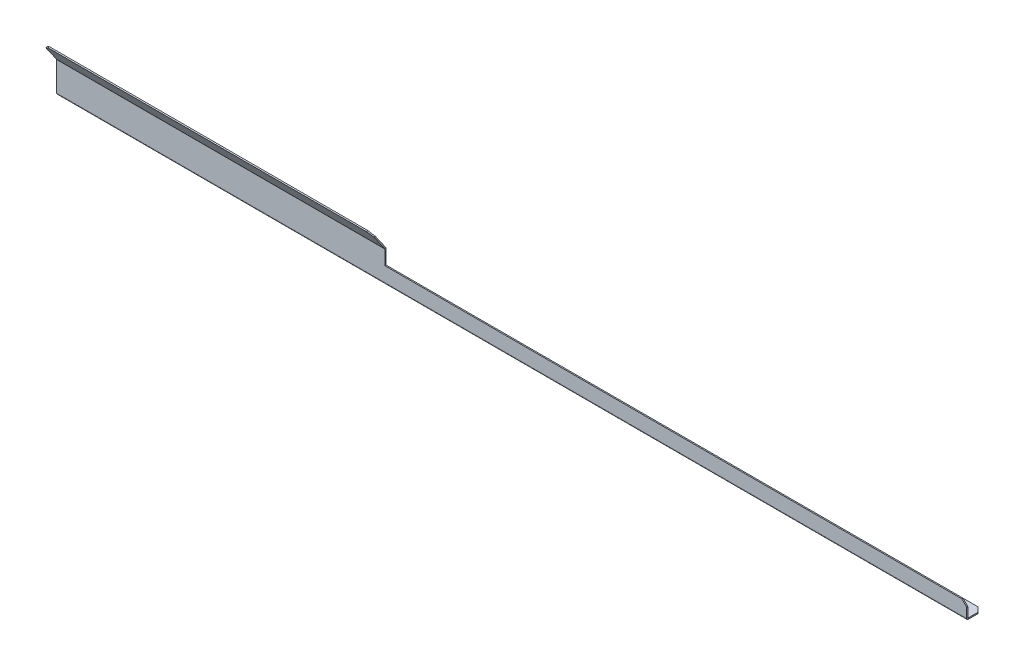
ISO-10303-21;
HEADER;
FILE_DESCRIPTION(('STEP AP214'),'2;1');
FILE_NAME('part.step','',(''),(''),'','','');
FILE_SCHEMA(('AUTOMOTIVE_DESIGN { 1 0 10303 214 1 1 1 1 }'));
ENDSEC;
DATA;
#1=APPLICATION_CONTEXT('core data for automotive mechanical design processes');
#2=APPLICATION_PROTOCOL_DEFINITION('international standard','automotive_design',2000,#1);
#3=PRODUCT_CONTEXT('',#1,'mechanical');
#4=PRODUCT('Part','Part','',(#3));
#5=PRODUCT_RELATED_PRODUCT_CATEGORY('part','',(#4));
#6=PRODUCT_DEFINITION_FORMATION('','',#4);
#7=PRODUCT_DEFINITION_CONTEXT('part definition',#1,'design');
#8=PRODUCT_DEFINITION('design','',#6,#7);
#9=PRODUCT_DEFINITION_SHAPE('','',#8);
#10=(LENGTH_UNIT() NAMED_UNIT(*) SI_UNIT(.MILLI.,.METRE.));
#11=(NAMED_UNIT(*) PLANE_ANGLE_UNIT() SI_UNIT($,.RADIAN.));
#12=(NAMED_UNIT(*) SI_UNIT($,.STERADIAN.) SOLID_ANGLE_UNIT());
#13=UNCERTAINTY_MEASURE_WITH_UNIT(LENGTH_MEASURE(1.E-05),#10,'distance_accuracy_value','');
#14=(GEOMETRIC_REPRESENTATION_CONTEXT(3) GLOBAL_UNCERTAINTY_ASSIGNED_CONTEXT((#13)) GLOBAL_UNIT_ASSIGNED_CONTEXT((#10,
#11,#12)) REPRESENTATION_CONTEXT('',''));
#15=CARTESIAN_POINT('',(0.,0.,0.));
#16=DIRECTION('',(0.,0.,1.));
#17=DIRECTION('',(1.,0.,0.));
#18=AXIS2_PLACEMENT_3D('',#15,#16,#17);
#19=CARTESIAN_POINT('',(3050.,98.9970824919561,54.180847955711));
#20=DIRECTION('',(1.,0.,0.));
#21=DIRECTION('',(0.,0.,-1.));
#22=AXIS2_PLACEMENT_3D('',#19,#20,#21);
#23=PLANE('',#22);
#24=DIRECTION('',(0.,1.,0.));
#25=VECTOR('',#24,1.);
#26=CARTESIAN_POINT('',(3050.,0.,50.));
#27=LINE('',#26,#25);
#28=CARTESIAN_POINT('',(3050.,0.999999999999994,50.));
#29=VERTEX_POINT('',#28);
#30=CARTESIAN_POINT('',(3050.,34.,50.));
#31=VERTEX_POINT('',#30);
#32=EDGE_CURVE('E217',#29,#31,#27,.T.);
#33=ORIENTED_EDGE('',*,*,#32,.T.);
#34=DIRECTION('',(0.,0.,1.));
#35=VECTOR('',#34,1.);
#36=CARTESIAN_POINT('',(3050.,34.,54.180847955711));
#37=LINE('',#36,#35);
#38=CARTESIAN_POINT('',(3050.,34.,54.));
#39=VERTEX_POINT('',#38);
#40=EDGE_CURVE('E313',#31,#39,#37,.T.);
#41=ORIENTED_EDGE('',*,*,#40,.T.);
#42=DIRECTION('',(0.,1.,0.));
#43=VECTOR('',#42,1.);
#44=CARTESIAN_POINT('',(3050.,50.,54.));
#45=LINE('',#44,#43);
#46=CARTESIAN_POINT('',(3050.,0.999999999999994,54.));
#47=VERTEX_POINT('',#46);
#48=EDGE_CURVE('E204',#47,#39,#45,.T.);
#49=ORIENTED_EDGE('',*,*,#48,.F.);
#50=DIRECTION('',(0.,0.,-1.));
#51=VECTOR('',#50,1.);
#52=CARTESIAN_POINT('',(3050.,0.999999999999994,54.));
#53=LINE('',#52,#51);
#54=EDGE_CURVE('E287',#47,#29,#53,.T.);
#55=ORIENTED_EDGE('',*,*,#54,.T.);
#56=EDGE_LOOP('',(#33,#41,#49,#55));
#57=FACE_BOUND('',#56,.T.);
#58=ADVANCED_FACE('F39',(#57),#23,.T.);
#59=CARTESIAN_POINT('',(3050.,100.,50.));
#60=DIRECTION('',(0.,-0.573576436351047,0.819152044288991));
#61=DIRECTION('',(0.,-0.819152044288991,-0.573576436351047));
#62=AXIS2_PLACEMENT_3D('',#59,#60,#61);
#63=PLANE('',#62);
#64=DIRECTION('',(0.,0.819152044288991,0.573576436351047));
#65=VECTOR('',#64,1.);
#66=CARTESIAN_POINT('',(0.,100.,50.));
#67=LINE('',#66,#65);
#68=CARTESIAN_POINT('',(0.,101.29138823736,50.904239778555));
#69=VERTEX_POINT('',#68);
#70=CARTESIAN_POINT('',(0.,152.425730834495,86.708891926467));
#71=VERTEX_POINT('',#70);
#72=EDGE_CURVE('E180',#69,#71,#67,.T.);
#73=ORIENTED_EDGE('',*,*,#72,.T.);
#74=DIRECTION('',(-0.707106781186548,-0.579227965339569,-0.405579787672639));
#75=VECTOR('',#74,1.);
#76=CARTESIAN_POINT('',(0.,152.425730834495,86.708891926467));
#77=LINE('',#76,#75);
#78=CARTESIAN_POINT('',(16.,165.532163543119,95.8861149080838));
#79=VERTEX_POINT('',#78);
#80=EDGE_CURVE('E307',#71,#79,#77,.F.);
#81=ORIENTED_EDGE('',*,*,#80,.T.);
#82=DIRECTION('',(-1.,0.,0.));
#83=VECTOR('',#82,1.);
#84=CARTESIAN_POINT('',(3050.,165.532163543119,95.8861149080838));
#85=LINE('',#84,#83);
#86=CARTESIAN_POINT('',(1084.,165.532163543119,95.8861149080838));
#87=VERTEX_POINT('',#86);
#88=EDGE_CURVE('E273',#87,#79,#85,.T.);
#89=ORIENTED_EDGE('',*,*,#88,.F.);
#90=DIRECTION('',(-0.707106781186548,0.579227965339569,0.40557978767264));
#91=VECTOR('',#90,1.);
#92=CARTESIAN_POINT('',(1084.,165.532163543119,95.8861149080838));
#93=LINE('',#92,#91);
#94=CARTESIAN_POINT('',(1100.,152.425730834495,86.708891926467));
#95=VERTEX_POINT('',#94);
#96=EDGE_CURVE('E298',#87,#95,#93,.F.);
#97=ORIENTED_EDGE('',*,*,#96,.T.);
#98=DIRECTION('',(0.,0.819152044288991,0.573576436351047));
#99=VECTOR('',#98,1.);
#100=CARTESIAN_POINT('',(1100.,100.,50.));
#101=LINE('',#100,#99);
#102=CARTESIAN_POINT('',(1100.,101.29138823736,50.904239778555));
#103=VERTEX_POINT('',#102);
#104=EDGE_CURVE('E196',#103,#95,#101,.T.);
#105=ORIENTED_EDGE('',*,*,#104,.F.);
#106=DIRECTION('',(-1.,0.,0.));
#107=VECTOR('',#106,1.);
#108=CARTESIAN_POINT('',(3050.,101.29138823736,50.904239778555));
#109=LINE('',#108,#107);
#110=EDGE_CURVE('E220',#103,#69,#109,.T.);
#111=ORIENTED_EDGE('',*,*,#110,.T.);
#112=EDGE_LOOP('',(#73,#81,#89,#97,#105,#111));
#113=FACE_BOUND('',#112,.T.);
#114=ADVANCED_FACE('F370',(#113),#63,.F.);
#115=CARTESIAN_POINT('',(3050.,163.237857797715,99.1627230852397));
#116=DIRECTION('',(0.,0.819152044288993,0.573576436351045));
#117=DIRECTION('',(0.,-0.573576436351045,0.819152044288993));
#118=AXIS2_PLACEMENT_3D('',#115,#116,#117);
#119=PLANE('',#118);
#120=ORIENTED_EDGE('',*,*,#88,.T.);
#121=DIRECTION('',(0.,-0.573576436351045,0.819152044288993));
#122=VECTOR('',#121,1.);
#123=CARTESIAN_POINT('',(16.,163.237857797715,99.1627230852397));
#124=LINE('',#123,#122);
#125=CARTESIAN_POINT('',(16.,163.237857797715,99.1627230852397));
#126=VERTEX_POINT('',#125);
#127=EDGE_CURVE('E309',#79,#126,#124,.T.);
#128=ORIENTED_EDGE('',*,*,#127,.T.);
#129=DIRECTION('',(-1.,0.,0.));
#130=VECTOR('',#129,1.);
#131=CARTESIAN_POINT('',(3050.,163.237857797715,99.1627230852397));
#132=LINE('',#131,#130);
#133=CARTESIAN_POINT('',(1084.,163.237857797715,99.1627230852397));
#134=VERTEX_POINT('',#133);
#135=EDGE_CURVE('E270',#134,#126,#132,.T.);
#136=ORIENTED_EDGE('',*,*,#135,.F.);
#137=DIRECTION('',(0.,0.573576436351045,-0.819152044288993));
#138=VECTOR('',#137,1.);
#139=CARTESIAN_POINT('',(1084.,163.237857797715,99.1627230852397));
#140=LINE('',#139,#138);
#141=EDGE_CURVE('E295',#134,#87,#140,.T.);
#142=ORIENTED_EDGE('',*,*,#141,.T.);
#143=EDGE_LOOP('',(#120,#128,#136,#142));
#144=FACE_BOUND('',#143,.T.);
#145=ADVANCED_FACE('F376',(#144),#119,.T.);
#146=CARTESIAN_POINT('',(3050.,97.7056942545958,53.276608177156));
#147=DIRECTION('',(0.,-0.573576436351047,0.819152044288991));
#148=DIRECTION('',(0.,-0.819152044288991,-0.573576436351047));
#149=AXIS2_PLACEMENT_3D('',#146,#147,#148);
#150=PLANE('',#149);
#151=ORIENTED_EDGE('',*,*,#135,.T.);
#152=DIRECTION('',(0.707106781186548,0.579227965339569,0.405579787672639));
#153=VECTOR('',#152,1.);
#154=CARTESIAN_POINT('',(1493.,1373.12542721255,946.335119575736));
#155=LINE('',#154,#153);
#156=CARTESIAN_POINT('',(0.,150.131425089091,89.985500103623));
#157=VERTEX_POINT('',#156);
#158=EDGE_CURVE('E311',#126,#157,#155,.F.);
#159=ORIENTED_EDGE('',*,*,#158,.T.);
#160=DIRECTION('',(0.,0.819152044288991,0.573576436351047));
#161=VECTOR('',#160,1.);
#162=CARTESIAN_POINT('',(0.,97.7056942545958,53.276608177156));
#163=LINE('',#162,#161);
#164=CARTESIAN_POINT('',(0.,98.9970824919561,54.180847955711));
#165=VERTEX_POINT('',#164);
#166=EDGE_CURVE('E223',#165,#157,#163,.T.);
#167=ORIENTED_EDGE('',*,*,#166,.F.);
#168=DIRECTION('',(-1.,0.,0.));
#169=VECTOR('',#168,1.);
#170=CARTESIAN_POINT('',(3050.,98.9970824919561,54.180847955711));
#171=LINE('',#170,#169);
#172=CARTESIAN_POINT('',(1100.,98.9970824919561,54.180847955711));
#173=VERTEX_POINT('',#172);
#174=EDGE_CURVE('E268',#173,#165,#171,.T.);
#175=ORIENTED_EDGE('',*,*,#174,.F.);
#176=DIRECTION('',(0.,0.819152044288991,0.573576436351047));
#177=VECTOR('',#176,1.);
#178=CARTESIAN_POINT('',(1100.,97.7056942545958,53.276608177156));
#179=LINE('',#178,#177);
#180=CARTESIAN_POINT('',(1100.,150.131425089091,89.985500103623));
#181=VERTEX_POINT('',#180);
#182=EDGE_CURVE('E200',#173,#181,#179,.T.);
#183=ORIENTED_EDGE('',*,*,#182,.T.);
#184=DIRECTION('',(0.707106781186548,-0.579227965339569,-0.40557978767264));
#185=VECTOR('',#184,1.);
#186=CARTESIAN_POINT('',(2107.,-674.754683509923,-487.605971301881));
#187=LINE('',#186,#185);
#188=EDGE_CURVE('E302',#181,#134,#187,.F.);
#189=ORIENTED_EDGE('',*,*,#188,.T.);
#190=EDGE_LOOP('',(#151,#159,#167,#175,#183,#189));
#191=FACE_BOUND('',#190,.T.);
#192=ADVANCED_FACE('F437',(#191),#150,.T.);
#193=CARTESIAN_POINT('',(3050.,98.4235060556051,55.));
#194=DIRECTION('',(-1.,0.,0.));
#195=DIRECTION('',(0.,0.,1.));
#196=AXIS2_PLACEMENT_3D('',#193,#194,#195);
#197=CYLINDRICAL_SURFACE('',#196,1.);
#198=DIRECTION('',(-1.,0.,0.));
#199=VECTOR('',#198,1.);
#200=CARTESIAN_POINT('',(3050.,98.4235060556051,54.));
#201=LINE('',#200,#199);
#202=CARTESIAN_POINT('',(1100.,98.4235060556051,54.));
#203=VERTEX_POINT('',#202);
#204=CARTESIAN_POINT('',(0.,98.4235060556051,54.));
#205=VERTEX_POINT('',#204);
#206=EDGE_CURVE('E266',#203,#205,#201,.T.);
#207=ORIENTED_EDGE('',*,*,#206,.F.);
#208=CARTESIAN_POINT('',(1100.,98.4235060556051,55.));
#209=DIRECTION('',(1.,0.,0.));
#210=DIRECTION('',(0.,0.,-1.));
#211=AXIS2_PLACEMENT_3D('',#208,#209,#210);
#212=CIRCLE('',#211,1.);
#213=EDGE_CURVE('E189',#203,#173,#212,.T.);
#214=ORIENTED_EDGE('',*,*,#213,.T.);
#215=ORIENTED_EDGE('',*,*,#174,.T.);
#216=CARTESIAN_POINT('',(0.,98.4235060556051,55.));
#217=DIRECTION('',(1.,0.,0.));
#218=DIRECTION('',(0.,0.,-1.));
#219=AXIS2_PLACEMENT_3D('',#216,#217,#218);
#220=CIRCLE('',#219,1.);
#221=EDGE_CURVE('E226',#205,#165,#220,.T.);
#222=ORIENTED_EDGE('',*,*,#221,.F.);
#223=EDGE_LOOP('',(#207,#214,#215,#222));
#224=FACE_BOUND('',#223,.T.);
#225=ADVANCED_FACE('F444',(#224),#197,.F.);
#226=CARTESIAN_POINT('',(3050.,0.,54.));
#227=DIRECTION('',(0.,0.,1.));
#228=DIRECTION('',(1.,0.,0.));
#229=AXIS2_PLACEMENT_3D('',#226,#227,#228);
#230=PLANE('',#229);
#231=ORIENTED_EDGE('',*,*,#48,.T.);
#232=DIRECTION('',(0.707106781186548,-0.707106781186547,0.));
#233=VECTOR('',#232,1.);
#234=CARTESIAN_POINT('',(3067.,17.,54.));
#235=LINE('',#234,#233);
#236=CARTESIAN_POINT('',(3034.,50.,54.));
#237=VERTEX_POINT('',#236);
#238=EDGE_CURVE('E176',#39,#237,#235,.F.);
#239=ORIENTED_EDGE('',*,*,#238,.T.);
#240=DIRECTION('',(-1.,0.,0.));
#241=VECTOR('',#240,1.);
#242=CARTESIAN_POINT('',(3050.,50.,54.));
#243=LINE('',#242,#241);
#244=CARTESIAN_POINT('',(1100.,50.,54.));
#245=VERTEX_POINT('',#244);
#246=EDGE_CURVE('E170',#237,#245,#243,.T.);
#247=ORIENTED_EDGE('',*,*,#246,.T.);
#248=DIRECTION('',(0.,1.,0.));
#249=VECTOR('',#248,1.);
#250=CARTESIAN_POINT('',(1100.,0.,54.));
#251=LINE('',#250,#249);
#252=EDGE_CURVE('E174',#245,#203,#251,.T.);
#253=ORIENTED_EDGE('',*,*,#252,.T.);
#254=ORIENTED_EDGE('',*,*,#206,.T.);
#255=DIRECTION('',(0.,1.,0.));
#256=VECTOR('',#255,1.);
#257=CARTESIAN_POINT('',(0.,0.,54.));
#258=LINE('',#257,#256);
#259=CARTESIAN_POINT('',(0.,0.999999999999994,54.));
#260=VERTEX_POINT('',#259);
#261=EDGE_CURVE('E229',#260,#205,#258,.T.);
#262=ORIENTED_EDGE('',*,*,#261,.F.);
#263=DIRECTION('',(-1.,0.,0.));
#264=VECTOR('',#263,1.);
#265=CARTESIAN_POINT('',(3050.,0.999999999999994,54.));
#266=LINE('',#265,#264);
#267=EDGE_CURVE('E263',#47,#260,#266,.T.);
#268=ORIENTED_EDGE('',*,*,#267,.F.);
#269=EDGE_LOOP('',(#231,#239,#247,#253,#254,#262,#268));
#270=FACE_BOUND('',#269,.T.);
#271=ADVANCED_FACE('F173',(#270),#230,.T.);
#272=CARTESIAN_POINT('',(3050.,50.,50.));
#273=DIRECTION('',(0.,0.,1.));
#274=DIRECTION('',(1.,0.,0.));
#275=AXIS2_PLACEMENT_3D('',#272,#273,#274);
#276=PLANE('',#275);
#277=DIRECTION('',(-1.,0.,0.));
#278=VECTOR('',#277,1.);
#279=CARTESIAN_POINT('',(3050.,50.,50.));
#280=LINE('',#279,#278);
#281=CARTESIAN_POINT('',(3034.,50.,50.));
#282=VERTEX_POINT('',#281);
#283=CARTESIAN_POINT('',(1100.,50.,50.));
#284=VERTEX_POINT('',#283);
#285=EDGE_CURVE('E193',#282,#284,#280,.T.);
#286=ORIENTED_EDGE('',*,*,#285,.F.);
#287=DIRECTION('',(-0.707106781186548,0.707106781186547,0.));
#288=VECTOR('',#287,1.);
#289=CARTESIAN_POINT('',(3050.,34.,50.));
#290=LINE('',#289,#288);
#291=EDGE_CURVE('E319',#282,#31,#290,.F.);
#292=ORIENTED_EDGE('',*,*,#291,.T.);
#293=ORIENTED_EDGE('',*,*,#32,.F.);
#294=DIRECTION('',(-1.,0.,0.));
#295=VECTOR('',#294,1.);
#296=CARTESIAN_POINT('',(3050.,0.999999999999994,50.));
#297=LINE('',#296,#295);
#298=CARTESIAN_POINT('',(0.,0.999999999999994,50.));
#299=VERTEX_POINT('',#298);
#300=EDGE_CURVE('E250',#29,#299,#297,.T.);
#301=ORIENTED_EDGE('',*,*,#300,.T.);
#302=DIRECTION('',(0.,1.,0.));
#303=VECTOR('',#302,1.);
#304=CARTESIAN_POINT('',(0.,50.,50.));
#305=LINE('',#304,#303);
#306=CARTESIAN_POINT('',(0.,98.4235060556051,50.));
#307=VERTEX_POINT('',#306);
#308=EDGE_CURVE('E242',#299,#307,#305,.T.);
#309=ORIENTED_EDGE('',*,*,#308,.T.);
#310=DIRECTION('',(-1.,0.,0.));
#311=VECTOR('',#310,1.);
#312=CARTESIAN_POINT('',(3050.,98.4235060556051,50.));
#313=LINE('',#312,#311);
#314=CARTESIAN_POINT('',(1100.,98.4235060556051,50.));
#315=VERTEX_POINT('',#314);
#316=EDGE_CURVE('E248',#315,#307,#313,.T.);
#317=ORIENTED_EDGE('',*,*,#316,.F.);
#318=DIRECTION('',(0.,1.,0.));
#319=VECTOR('',#318,1.);
#320=CARTESIAN_POINT('',(1100.,50.,50.));
#321=LINE('',#320,#319);
#322=EDGE_CURVE('E194',#284,#315,#321,.T.);
#323=ORIENTED_EDGE('',*,*,#322,.F.);
#324=EDGE_LOOP('',(#286,#292,#293,#301,#309,#317,#323));
#325=FACE_BOUND('',#324,.T.);
#326=ADVANCED_FACE('F414',(#325),#276,.F.);
#327=CARTESIAN_POINT('',(3050.,98.4235060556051,55.));
#328=DIRECTION('',(-1.,0.,0.));
#329=DIRECTION('',(0.,0.,1.));
#330=AXIS2_PLACEMENT_3D('',#327,#328,#329);
#331=CYLINDRICAL_SURFACE('',#330,5.);
#332=CARTESIAN_POINT('',(1100.,98.4235060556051,55.));
#333=DIRECTION('',(1.,0.,0.));
#334=DIRECTION('',(0.,0.,-1.));
#335=AXIS2_PLACEMENT_3D('',#332,#333,#334);
#336=CIRCLE('',#335,5.);
#337=EDGE_CURVE('E292',#315,#103,#336,.T.);
#338=ORIENTED_EDGE('',*,*,#337,.F.);
#339=ORIENTED_EDGE('',*,*,#316,.T.);
#340=CARTESIAN_POINT('',(0.,98.4235060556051,55.));
#341=DIRECTION('',(-1.,0.,0.));
#342=DIRECTION('',(0.,0.,1.));
#343=AXIS2_PLACEMENT_3D('',#340,#341,#342);
#344=CIRCLE('',#343,5.);
#345=EDGE_CURVE('E207',#307,#69,#344,.F.);
#346=ORIENTED_EDGE('',*,*,#345,.T.);
#347=ORIENTED_EDGE('',*,*,#110,.F.);
#348=EDGE_LOOP('',(#338,#339,#346,#347));
#349=FACE_BOUND('',#348,.T.);
#350=ADVANCED_FACE('F396',(#349),#331,.T.);
#351=CARTESIAN_POINT('',(3050.,0.,49.));
#352=DIRECTION('',(1.,0.,0.));
#353=DIRECTION('',(0.,0.,-1.));
#354=AXIS2_PLACEMENT_3D('',#351,#352,#353);
#355=PLANE('',#354);
#356=DIRECTION('',(0.,-1.,0.));
#357=VECTOR('',#356,1.);
#358=CARTESIAN_POINT('',(3050.,0.,49.));
#359=LINE('',#358,#357);
#360=CARTESIAN_POINT('',(3050.,0.,49.));
#361=VERTEX_POINT('',#360);
#362=CARTESIAN_POINT('',(3050.,-4.00000000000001,49.));
#363=VERTEX_POINT('',#362);
#364=EDGE_CURVE('E289',#361,#363,#359,.T.);
#365=ORIENTED_EDGE('',*,*,#364,.F.);
#366=CARTESIAN_POINT('',(3050.,0.999999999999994,49.));
#367=DIRECTION('',(1.,0.,0.));
#368=DIRECTION('',(0.,0.,-1.));
#369=AXIS2_PLACEMENT_3D('',#366,#367,#368);
#370=CIRCLE('',#369,1.);
#371=EDGE_CURVE('E214',#361,#29,#370,.F.);
#372=ORIENTED_EDGE('',*,*,#371,.T.);
#373=ORIENTED_EDGE('',*,*,#54,.F.);
#374=CARTESIAN_POINT('',(3050.,0.999999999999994,49.));
#375=DIRECTION('',(1.,0.,0.));
#376=DIRECTION('',(0.,0.,-1.));
#377=AXIS2_PLACEMENT_3D('',#374,#375,#376);
#378=CIRCLE('',#377,5.);
#379=EDGE_CURVE('E206',#363,#47,#378,.F.);
#380=ORIENTED_EDGE('',*,*,#379,.F.);
#381=EDGE_LOOP('',(#365,#372,#373,#380));
#382=FACE_BOUND('',#381,.T.);
#383=ADVANCED_FACE('F392',(#382),#355,.T.);
#384=CARTESIAN_POINT('',(3050.,0.999999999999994,54.));
#385=DIRECTION('',(1.,0.,0.));
#386=DIRECTION('',(0.,0.,-1.));
#387=AXIS2_PLACEMENT_3D('',#384,#385,#386);
#388=PLANE('',#387);
#389=DIRECTION('',(0.,0.,1.));
#390=VECTOR('',#389,1.);
#391=CARTESIAN_POINT('',(3050.,-4.,0.));
#392=LINE('',#391,#390);
#393=CARTESIAN_POINT('',(3050.,-4.,16.));
#394=VERTEX_POINT('',#393);
#395=EDGE_CURVE('E210',#394,#363,#392,.T.);
#396=ORIENTED_EDGE('',*,*,#395,.F.);
#397=DIRECTION('',(0.,1.,0.));
#398=VECTOR('',#397,1.);
#399=CARTESIAN_POINT('',(3050.,0.999999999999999,16.));
#400=LINE('',#399,#398);
#401=CARTESIAN_POINT('',(3050.,0.,16.));
#402=VERTEX_POINT('',#401);
#403=EDGE_CURVE('E326',#394,#402,#400,.T.);
#404=ORIENTED_EDGE('',*,*,#403,.T.);
#405=DIRECTION('',(0.,0.,1.));
#406=VECTOR('',#405,1.);
#407=CARTESIAN_POINT('',(3050.,0.,0.));
#408=LINE('',#407,#406);
#409=EDGE_CURVE('E212',#402,#361,#408,.T.);
#410=ORIENTED_EDGE('',*,*,#409,.T.);
#411=ORIENTED_EDGE('',*,*,#364,.T.);
#412=EDGE_LOOP('',(#396,#404,#410,#411));
#413=FACE_BOUND('',#412,.T.);
#414=ADVANCED_FACE('F389',(#413),#388,.T.);
#415=CARTESIAN_POINT('',(0.,0.999999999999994,50.));
#416=DIRECTION('',(-1.,0.,0.));
#417=DIRECTION('',(0.,0.,1.));
#418=AXIS2_PLACEMENT_3D('',#415,#416,#417);
#419=PLANE('',#418);
#420=DIRECTION('',(0.,0.,1.));
#421=VECTOR('',#420,1.);
#422=CARTESIAN_POINT('',(0.,0.999999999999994,50.));
#423=LINE('',#422,#421);
#424=EDGE_CURVE('E285',#299,#260,#423,.T.);
#425=ORIENTED_EDGE('',*,*,#424,.F.);
#426=CARTESIAN_POINT('',(0.,0.999999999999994,49.));
#427=DIRECTION('',(1.,0.,0.));
#428=DIRECTION('',(0.,0.,-1.));
#429=AXIS2_PLACEMENT_3D('',#426,#427,#428);
#430=CIRCLE('',#429,1.);
#431=CARTESIAN_POINT('',(0.,0.,49.));
#432=VERTEX_POINT('',#431);
#433=EDGE_CURVE('E239',#432,#299,#430,.F.);
#434=ORIENTED_EDGE('',*,*,#433,.F.);
#435=DIRECTION('',(0.,1.,0.));
#436=VECTOR('',#435,1.);
#437=CARTESIAN_POINT('',(0.,-4.00000000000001,49.));
#438=LINE('',#437,#436);
#439=CARTESIAN_POINT('',(0.,-4.00000000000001,49.));
#440=VERTEX_POINT('',#439);
#441=EDGE_CURVE('E282',#440,#432,#438,.T.);
#442=ORIENTED_EDGE('',*,*,#441,.F.);
#443=CARTESIAN_POINT('',(0.,0.999999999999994,49.));
#444=DIRECTION('',(1.,0.,0.));
#445=DIRECTION('',(0.,0.,-1.));
#446=AXIS2_PLACEMENT_3D('',#443,#444,#445);
#447=CIRCLE('',#446,5.);
#448=EDGE_CURVE('E232',#440,#260,#447,.F.);
#449=ORIENTED_EDGE('',*,*,#448,.T.);
#450=EDGE_LOOP('',(#425,#434,#442,#449));
#451=FACE_BOUND('',#450,.T.);
#452=ADVANCED_FACE('F350',(#451),#419,.T.);
#453=CARTESIAN_POINT('',(0.,-4.00000000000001,49.));
#454=DIRECTION('',(-1.,0.,0.));
#455=DIRECTION('',(0.,0.,1.));
#456=AXIS2_PLACEMENT_3D('',#453,#454,#455);
#457=PLANE('',#456);
#458=ORIENTED_EDGE('',*,*,#308,.F.);
#459=ORIENTED_EDGE('',*,*,#424,.T.);
#460=ORIENTED_EDGE('',*,*,#261,.T.);
#461=DIRECTION('',(0.,0.,-1.));
#462=VECTOR('',#461,1.);
#463=CARTESIAN_POINT('',(0.,98.4235060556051,54.));
#464=LINE('',#463,#462);
#465=EDGE_CURVE('E276',#205,#307,#464,.T.);
#466=ORIENTED_EDGE('',*,*,#465,.T.);
#467=EDGE_LOOP('',(#458,#459,#460,#466));
#468=FACE_BOUND('',#467,.T.);
#469=ADVANCED_FACE('F383',(#468),#457,.T.);
#470=CARTESIAN_POINT('',(0.,101.29138823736,50.904239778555));
#471=DIRECTION('',(-1.,0.,0.));
#472=DIRECTION('',(0.,0.,1.));
#473=AXIS2_PLACEMENT_3D('',#470,#471,#472);
#474=PLANE('',#473);
#475=DIRECTION('',(0.,-0.573576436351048,0.819152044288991));
#476=VECTOR('',#475,1.);
#477=CARTESIAN_POINT('',(0.,101.29138823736,50.904239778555));
#478=LINE('',#477,#476);
#479=EDGE_CURVE('E279',#69,#165,#478,.T.);
#480=ORIENTED_EDGE('',*,*,#479,.F.);
#481=ORIENTED_EDGE('',*,*,#345,.F.);
#482=ORIENTED_EDGE('',*,*,#465,.F.);
#483=ORIENTED_EDGE('',*,*,#221,.T.);
#484=EDGE_LOOP('',(#480,#481,#482,#483));
#485=FACE_BOUND('',#484,.T.);
#486=ADVANCED_FACE('F381',(#485),#474,.T.);
#487=CARTESIAN_POINT('',(0.,98.4235060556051,54.));
#488=DIRECTION('',(-1.,0.,0.));
#489=DIRECTION('',(0.,0.,1.));
#490=AXIS2_PLACEMENT_3D('',#487,#488,#489);
#491=PLANE('',#490);
#492=ORIENTED_EDGE('',*,*,#166,.T.);
#493=DIRECTION('',(0.,0.573576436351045,-0.819152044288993));
#494=VECTOR('',#493,1.);
#495=CARTESIAN_POINT('',(0.,150.027694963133,90.133642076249));
#496=LINE('',#495,#494);
#497=EDGE_CURVE('E304',#157,#71,#496,.T.);
#498=ORIENTED_EDGE('',*,*,#497,.T.);
#499=ORIENTED_EDGE('',*,*,#72,.F.);
#500=ORIENTED_EDGE('',*,*,#479,.T.);
#501=EDGE_LOOP('',(#492,#498,#499,#500));
#502=FACE_BOUND('',#501,.T.);
#503=ADVANCED_FACE('F427',(#502),#491,.T.);
#504=CARTESIAN_POINT('',(3050.,0.999999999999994,49.));
#505=DIRECTION('',(-1.,0.,0.));
#506=DIRECTION('',(0.,0.,1.));
#507=AXIS2_PLACEMENT_3D('',#504,#505,#506);
#508=CYLINDRICAL_SURFACE('',#507,5.);
#509=ORIENTED_EDGE('',*,*,#448,.F.);
#510=DIRECTION('',(-1.,0.,0.));
#511=VECTOR('',#510,1.);
#512=CARTESIAN_POINT('',(3050.,-4.00000000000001,49.));
#513=LINE('',#512,#511);
#514=EDGE_CURVE('E260',#363,#440,#513,.T.);
#515=ORIENTED_EDGE('',*,*,#514,.F.);
#516=ORIENTED_EDGE('',*,*,#379,.T.);
#517=ORIENTED_EDGE('',*,*,#267,.T.);
#518=EDGE_LOOP('',(#509,#515,#516,#517));
#519=FACE_BOUND('',#518,.T.);
#520=ADVANCED_FACE('F346',(#519),#508,.T.);
#521=CARTESIAN_POINT('',(3050.,-4.,0.));
#522=DIRECTION('',(0.,-1.,0.));
#523=DIRECTION('',(0.,0.,-1.));
#524=AXIS2_PLACEMENT_3D('',#521,#522,#523);
#525=PLANE('',#524);
#526=DIRECTION('',(0.,0.,1.));
#527=VECTOR('',#526,1.);
#528=CARTESIAN_POINT('',(0.,-4.,0.));
#529=LINE('',#528,#527);
#530=CARTESIAN_POINT('',(0.,-4.,16.));
#531=VERTEX_POINT('',#530);
#532=EDGE_CURVE('E235',#531,#440,#529,.T.);
#533=ORIENTED_EDGE('',*,*,#532,.F.);
#534=DIRECTION('',(0.707106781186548,0.,-0.707106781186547));
#535=VECTOR('',#534,1.);
#536=CARTESIAN_POINT('',(1533.,-3.99999999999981,-1517.));
#537=LINE('',#536,#535);
#538=CARTESIAN_POINT('',(16.,-4.,0.));
#539=VERTEX_POINT('',#538);
#540=EDGE_CURVE('E61',#531,#539,#537,.T.);
#541=ORIENTED_EDGE('',*,*,#540,.T.);
#542=DIRECTION('',(-1.,0.,0.));
#543=VECTOR('',#542,1.);
#544=CARTESIAN_POINT('',(3050.,-4.,0.));
#545=LINE('',#544,#543);
#546=CARTESIAN_POINT('',(3034.,-4.,0.));
#547=VERTEX_POINT('',#546);
#548=EDGE_CURVE('E258',#547,#539,#545,.T.);
#549=ORIENTED_EDGE('',*,*,#548,.F.);
#550=DIRECTION('',(-0.707106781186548,0.,-0.707106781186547));
#551=VECTOR('',#550,1.);
#552=CARTESIAN_POINT('',(3042.,-4.,8.00000000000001));
#553=LINE('',#552,#551);
#554=EDGE_CURVE('E324',#547,#394,#553,.F.);
#555=ORIENTED_EDGE('',*,*,#554,.T.);
#556=ORIENTED_EDGE('',*,*,#395,.T.);
#557=ORIENTED_EDGE('',*,*,#514,.T.);
#558=EDGE_LOOP('',(#533,#541,#549,#555,#556,#557));
#559=FACE_BOUND('',#558,.T.);
#560=ADVANCED_FACE('F340',(#559),#525,.T.);
#561=CARTESIAN_POINT('',(3050.,0.,0.));
#562=DIRECTION('',(0.,0.,-1.));
#563=DIRECTION('',(0.,1.,0.));
#564=AXIS2_PLACEMENT_3D('',#561,#562,#563);
#565=PLANE('',#564);
#566=ORIENTED_EDGE('',*,*,#548,.T.);
#567=DIRECTION('',(0.,1.,0.));
#568=VECTOR('',#567,1.);
#569=CARTESIAN_POINT('',(16.,0.,0.));
#570=LINE('',#569,#568);
#571=CARTESIAN_POINT('',(16.,0.,0.));
#572=VERTEX_POINT('',#571);
#573=EDGE_CURVE('E47',#539,#572,#570,.T.);
#574=ORIENTED_EDGE('',*,*,#573,.T.);
#575=DIRECTION('',(-1.,0.,0.));
#576=VECTOR('',#575,1.);
#577=CARTESIAN_POINT('',(3050.,0.,0.));
#578=LINE('',#577,#576);
#579=CARTESIAN_POINT('',(3034.,0.,0.));
#580=VERTEX_POINT('',#579);
#581=EDGE_CURVE('E256',#580,#572,#578,.T.);
#582=ORIENTED_EDGE('',*,*,#581,.F.);
#583=DIRECTION('',(0.,-1.,0.));
#584=VECTOR('',#583,1.);
#585=CARTESIAN_POINT('',(3034.,0.,0.));
#586=LINE('',#585,#584);
#587=EDGE_CURVE('E321',#580,#547,#586,.T.);
#588=ORIENTED_EDGE('',*,*,#587,.T.);
#589=EDGE_LOOP('',(#566,#574,#582,#588));
#590=FACE_BOUND('',#589,.T.);
#591=ADVANCED_FACE('F598',(#590),#565,.T.);
#592=CARTESIAN_POINT('',(3050.,0.,0.));
#593=DIRECTION('',(0.,-1.,0.));
#594=DIRECTION('',(0.,0.,-1.));
#595=AXIS2_PLACEMENT_3D('',#592,#593,#594);
#596=PLANE('',#595);
#597=ORIENTED_EDGE('',*,*,#581,.T.);
#598=DIRECTION('',(-0.707106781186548,0.,0.707106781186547));
#599=VECTOR('',#598,1.);
#600=CARTESIAN_POINT('',(0.,0.,16.));
#601=LINE('',#600,#599);
#602=CARTESIAN_POINT('',(0.,0.,16.));
#603=VERTEX_POINT('',#602);
#604=EDGE_CURVE('E11',#572,#603,#601,.T.);
#605=ORIENTED_EDGE('',*,*,#604,.T.);
#606=DIRECTION('',(0.,0.,1.));
#607=VECTOR('',#606,1.);
#608=CARTESIAN_POINT('',(0.,0.,0.));
#609=LINE('',#608,#607);
#610=EDGE_CURVE('E237',#603,#432,#609,.T.);
#611=ORIENTED_EDGE('',*,*,#610,.T.);
#612=DIRECTION('',(-1.,0.,0.));
#613=VECTOR('',#612,1.);
#614=CARTESIAN_POINT('',(3050.,0.,49.));
#615=LINE('',#614,#613);
#616=EDGE_CURVE('E253',#361,#432,#615,.T.);
#617=ORIENTED_EDGE('',*,*,#616,.F.);
#618=ORIENTED_EDGE('',*,*,#409,.F.);
#619=DIRECTION('',(0.707106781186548,0.,0.707106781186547));
#620=VECTOR('',#619,1.);
#621=CARTESIAN_POINT('',(3034.,0.,0.));
#622=LINE('',#621,#620);
#623=EDGE_CURVE('E328',#402,#580,#622,.F.);
#624=ORIENTED_EDGE('',*,*,#623,.T.);
#625=EDGE_LOOP('',(#597,#605,#611,#617,#618,#624));
#626=FACE_BOUND('',#625,.T.);
#627=ADVANCED_FACE('F360',(#626),#596,.F.);
#628=CARTESIAN_POINT('',(3050.,0.999999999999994,49.));
#629=DIRECTION('',(-1.,0.,0.));
#630=DIRECTION('',(0.,0.,1.));
#631=AXIS2_PLACEMENT_3D('',#628,#629,#630);
#632=CYLINDRICAL_SURFACE('',#631,1.);
#633=ORIENTED_EDGE('',*,*,#433,.T.);
#634=ORIENTED_EDGE('',*,*,#300,.F.);
#635=ORIENTED_EDGE('',*,*,#371,.F.);
#636=ORIENTED_EDGE('',*,*,#616,.T.);
#637=EDGE_LOOP('',(#633,#634,#635,#636));
#638=FACE_BOUND('',#637,.T.);
#639=ADVANCED_FACE('F356',(#638),#632,.F.);
#640=CARTESIAN_POINT('',(0.,98.4235060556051,55.));
#641=DIRECTION('',(1.,0.,0.));
#642=DIRECTION('',(0.,0.,-1.));
#643=AXIS2_PLACEMENT_3D('',#640,#641,#642);
#644=PLANE('',#643);
#645=ORIENTED_EDGE('',*,*,#610,.F.);
#646=DIRECTION('',(0.,-1.,0.));
#647=VECTOR('',#646,1.);
#648=CARTESIAN_POINT('',(0.,-4.,16.));
#649=LINE('',#648,#647);
#650=EDGE_CURVE('E330',#603,#531,#649,.T.);
#651=ORIENTED_EDGE('',*,*,#650,.T.);
#652=ORIENTED_EDGE('',*,*,#532,.T.);
#653=ORIENTED_EDGE('',*,*,#441,.T.);
#654=EDGE_LOOP('',(#645,#651,#652,#653));
#655=FACE_BOUND('',#654,.T.);
#656=ADVANCED_FACE('F336',(#655),#644,.F.);
#657=CARTESIAN_POINT('',(1100.,428.556312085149,99.1627230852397));
#658=DIRECTION('',(1.,0.,0.));
#659=DIRECTION('',(0.,0.,-1.));
#660=AXIS2_PLACEMENT_3D('',#657,#658,#659);
#661=PLANE('',#660);
#662=ORIENTED_EDGE('',*,*,#104,.T.);
#663=DIRECTION('',(0.,-0.573576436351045,0.819152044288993));
#664=VECTOR('',#663,1.);
#665=CARTESIAN_POINT('',(1100.,237.418524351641,-34.6733967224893));
#666=LINE('',#665,#664);
#667=EDGE_CURVE('E300',#95,#181,#666,.T.);
#668=ORIENTED_EDGE('',*,*,#667,.T.);
#669=ORIENTED_EDGE('',*,*,#182,.F.);
#670=ORIENTED_EDGE('',*,*,#213,.F.);
#671=ORIENTED_EDGE('',*,*,#252,.F.);
#672=DIRECTION('',(0.,0.,-1.));
#673=VECTOR('',#672,1.);
#674=CARTESIAN_POINT('',(1100.,50.,99.1627230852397));
#675=LINE('',#674,#673);
#676=EDGE_CURVE('E186',#245,#284,#675,.T.);
#677=ORIENTED_EDGE('',*,*,#676,.T.);
#678=ORIENTED_EDGE('',*,*,#322,.T.);
#679=ORIENTED_EDGE('',*,*,#337,.T.);
#680=EDGE_LOOP('',(#662,#668,#669,#670,#671,#677,#678,#679));
#681=FACE_BOUND('',#680,.T.);
#682=ADVANCED_FACE('F185',(#681),#661,.T.);
#683=CARTESIAN_POINT('',(1100.,50.,99.1627230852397));
#684=DIRECTION('',(0.,1.,0.));
#685=DIRECTION('',(0.,0.,1.));
#686=AXIS2_PLACEMENT_3D('',#683,#684,#685);
#687=PLANE('',#686);
#688=ORIENTED_EDGE('',*,*,#246,.F.);
#689=DIRECTION('',(0.,0.,-1.));
#690=VECTOR('',#689,1.);
#691=CARTESIAN_POINT('',(3034.,50.,99.1627230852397));
#692=LINE('',#691,#690);
#693=EDGE_CURVE('E317',#237,#282,#692,.T.);
#694=ORIENTED_EDGE('',*,*,#693,.T.);
#695=ORIENTED_EDGE('',*,*,#285,.T.);
#696=ORIENTED_EDGE('',*,*,#676,.F.);
#697=EDGE_LOOP('',(#688,#694,#695,#696));
#698=FACE_BOUND('',#697,.T.);
#699=ADVANCED_FACE('F191',(#698),#687,.T.);
#700=CARTESIAN_POINT('',(1084.,163.237857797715,99.1627230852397));
#701=DIRECTION('',(-0.707106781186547,-0.57922796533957,-0.405579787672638));
#702=DIRECTION('',(0.633687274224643,-0.773589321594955,0.));
#703=AXIS2_PLACEMENT_3D('',#700,#701,#702);
#704=PLANE('',#703);
#705=ORIENTED_EDGE('',*,*,#188,.F.);
#706=ORIENTED_EDGE('',*,*,#667,.F.);
#707=ORIENTED_EDGE('',*,*,#96,.F.);
#708=ORIENTED_EDGE('',*,*,#141,.F.);
#709=EDGE_LOOP('',(#705,#706,#707,#708));
#710=FACE_BOUND('',#709,.T.);
#711=ADVANCED_FACE('F398',(#710),#704,.F.);
#712=CARTESIAN_POINT('',(0.,150.027694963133,90.133642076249));
#713=DIRECTION('',(0.707106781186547,-0.57922796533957,-0.405579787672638));
#714=DIRECTION('',(0.633687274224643,0.773589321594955,0.));
#715=AXIS2_PLACEMENT_3D('',#712,#713,#714);
#716=PLANE('',#715);
#717=ORIENTED_EDGE('',*,*,#158,.F.);
#718=ORIENTED_EDGE('',*,*,#127,.F.);
#719=ORIENTED_EDGE('',*,*,#80,.F.);
#720=ORIENTED_EDGE('',*,*,#497,.F.);
#721=EDGE_LOOP('',(#717,#718,#719,#720));
#722=FACE_BOUND('',#721,.T.);
#723=ADVANCED_FACE('F401',(#722),#716,.F.);
#724=CARTESIAN_POINT('',(3050.,34.,54.180847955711));
#725=DIRECTION('',(-0.707106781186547,-0.707106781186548,0.));
#726=DIRECTION('',(0.707106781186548,-0.707106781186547,0.));
#727=AXIS2_PLACEMENT_3D('',#724,#725,#726);
#728=PLANE('',#727);
#729=ORIENTED_EDGE('',*,*,#291,.F.);
#730=ORIENTED_EDGE('',*,*,#693,.F.);
#731=ORIENTED_EDGE('',*,*,#238,.F.);
#732=ORIENTED_EDGE('',*,*,#40,.F.);
#733=EDGE_LOOP('',(#729,#730,#731,#732));
#734=FACE_BOUND('',#733,.T.);
#735=ADVANCED_FACE('F367',(#734),#728,.F.);
#736=CARTESIAN_POINT('',(3034.,0.,0.));
#737=DIRECTION('',(-0.707106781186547,0.,0.707106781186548));
#738=DIRECTION('',(0.707106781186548,0.,0.707106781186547));
#739=AXIS2_PLACEMENT_3D('',#736,#737,#738);
#740=PLANE('',#739);
#741=ORIENTED_EDGE('',*,*,#623,.F.);
#742=ORIENTED_EDGE('',*,*,#403,.F.);
#743=ORIENTED_EDGE('',*,*,#554,.F.);
#744=ORIENTED_EDGE('',*,*,#587,.F.);
#745=EDGE_LOOP('',(#741,#742,#743,#744));
#746=FACE_BOUND('',#745,.T.);
#747=ADVANCED_FACE('F363',(#746),#740,.F.);
#748=CARTESIAN_POINT('',(0.,98.4235060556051,16.));
#749=DIRECTION('',(-0.707106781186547,0.,-0.707106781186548));
#750=DIRECTION('',(-0.707106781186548,0.,0.707106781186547));
#751=AXIS2_PLACEMENT_3D('',#748,#749,#750);
#752=PLANE('',#751);
#753=ORIENTED_EDGE('',*,*,#604,.F.);
#754=ORIENTED_EDGE('',*,*,#573,.F.);
#755=ORIENTED_EDGE('',*,*,#540,.F.);
#756=ORIENTED_EDGE('',*,*,#650,.F.);
#757=EDGE_LOOP('',(#753,#754,#755,#756));
#758=FACE_BOUND('',#757,.T.);
#759=ADVANCED_FACE('F41',(#758),#752,.T.);
#760=CLOSED_SHELL('',(#58,#114,#145,#192,#225,#271,#326,#350,#383,#414,#452,#469,#486,#503,#520,
#560,#591,#627,#639,#656,#682,#699,#711,#723,#735,#747,#759));
#761=MANIFOLD_SOLID_BREP('B2',#760);
#762=ADVANCED_BREP_SHAPE_REPRESENTATION('',(#18,#761),#14);
#763=SHAPE_DEFINITION_REPRESENTATION(#9,#762);
ENDSEC;
END-ISO-10303-21;
